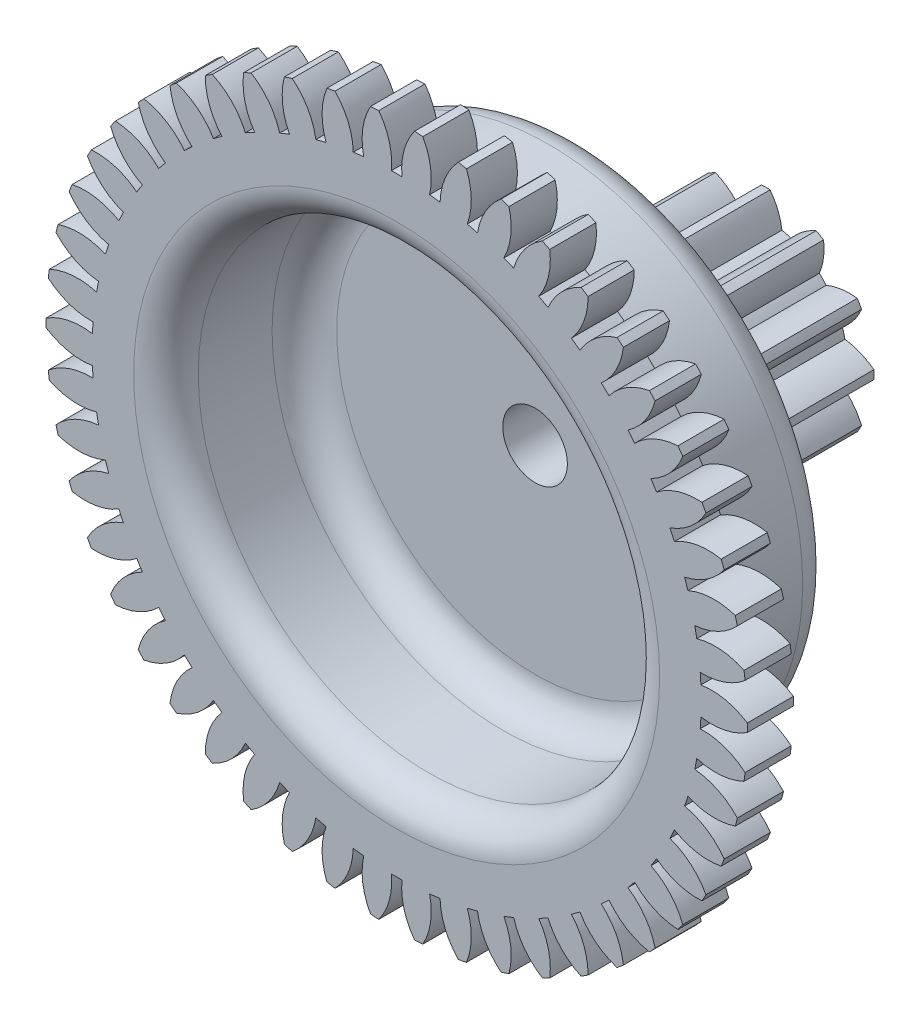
from build123d import *

# Parameters (mm, degrees)
SKETCH1_R          = 6.6
EXTRUDE1_DEPTH     = 0.5
EXTRUDE2_DEPTH     = 1
CIRPATTERN1_COUNT  = 50
SKETCH3_R          = 5.5
EXTRUDE4_DEPTH     = 3
EXTRUDE3_DEPTH     = 4
CIRPATTERN2_COUNT  = 12
SKETCH5_R          = 0.7
CUT_EXTRUDE2_DEPTH = 8
CUT_EXTRUDE4_START = -3
SKETCH6_R          = 5
SKETCH6_R_2        = 0.7
CUT_EXTRUDE4_DEPTH = 3
FILLET1_R          = 0.7


with BuildPart() as part:
    # Sketch1 → Extrude1 (new, symmetric)
    with BuildSketch(Plane.XY):
        Circle(SKETCH1_R)
    extrude(amount=EXTRUDE1_DEPTH, both=True)

    # Sketch2 → Extrude2 (add)
    with BuildSketch(Plane.XY.offset(0.5)):
        with BuildLine():
            ThreePointArc((-6.593178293, 0.3), (-6.6, 0), (-6.593178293, -0.3))
            ThreePointArc((-6.593178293, -0.3), (-7.115845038, -0.288548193), (-7.599467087, -0.09))
            ThreePointArc((-7.599467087, -0.09), (-7.6, 0), (-7.599467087, 0.09))
            ThreePointArc((-7.599467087, 0.09), (-7.115829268, 0.288472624), (-6.593178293, 0.3))
        make_face()
    extrude2 = extrude(amount=-EXTRUDE2_DEPTH)

    # CirPattern1: Extrude2 ×50 about axis
    cirpattern1_axis = Axis((0, 0, 0), (0, 0, 1))
    for i in range(1, CIRPATTERN1_COUNT):
        add(extrude2.rotate(cirpattern1_axis, i * 360 / CIRPATTERN1_COUNT))

    # Sketch3 → Extrude4 (add)
    with BuildSketch(Plane(origin=(0, 0, -0.5), x_dir=(-1, 0, 0), z_dir=(0, 0, -1))):
        with Locations(Location((0, 0, 0), (0, 0, 180))):
            Circle(SKETCH3_R)
    extrude(amount=EXTRUDE4_DEPTH)

    # Sketch4 → Extrude3 (add)
    with BuildSketch(Plane(origin=(0, 0, -3.5), x_dir=(-1, 0, 0), z_dir=(0, 0, -1))):
        with BuildLine():
            ThreePointArc((-0.35, 1.71464282), (0, -1.75), (0.35, 1.71464282))
            ThreePointArc((0.35, 1.71464282), (0.262103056, 2.045627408), (0.09287198, 2.343347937))
            ThreePointArc((0.09287198, 2.343347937), (0, 2.345187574), (-0.09287198, 2.343347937))
            ThreePointArc((-0.09287198, 2.343347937), (-0.262103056, 2.045627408), (-0.35, 1.71464282))
        make_face()
    extrude3 = extrude(amount=EXTRUDE3_DEPTH)

    # CirPattern2: Extrude3 ×12 about axis
    cirpattern2_axis = Axis((0, 0, 0), (0, 0, 1))
    for i in range(1, CIRPATTERN2_COUNT):
        add(extrude3.rotate(cirpattern2_axis, i * 360 / CIRPATTERN2_COUNT))

    # Sketch5 → Cut-Extrude2 (cut)
    with BuildSketch(Plane(origin=(0, 0, -7.5), x_dir=(-1, 0, 0), z_dir=(0, 0, -1))):
        Circle(SKETCH5_R)
    extrude(amount=-CUT_EXTRUDE2_DEPTH, mode=Mode.SUBTRACT)

    # Sketch6 → Cut-Extrude4 (cut)
    with BuildSketch(Plane.XY.offset(0.5).offset(CUT_EXTRUDE4_START)):
        Circle(SKETCH6_R)
        with Locations(Location((0, 0, 0), (0, 0, 180))):
            Circle(SKETCH6_R_2, mode=Mode.SUBTRACT)
    extrude(amount=CUT_EXTRUDE4_DEPTH, mode=Mode.SUBTRACT)

    # Fillet1
    fillet1_edges = [part.edges().sort_by_distance(p)[0] for p in [
        (-5.5, 0, -3.5),
        (-5, 0, -2.5),
        (-5, 0, 0.5),
    ]]
    fillet(fillet1_edges, radius=FILLET1_R)


solid = part.part
